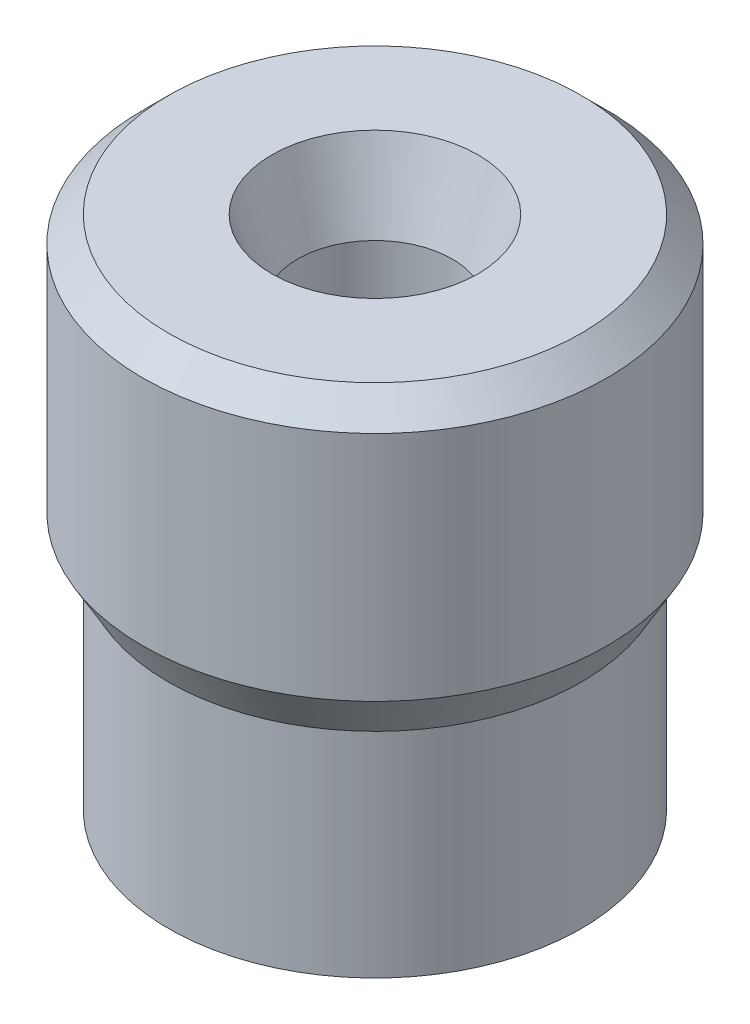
from build123d import *

# Parameters (mm, degrees)
SKICA1_R                 = 8
P_IDAT_VYSUNUT_M1_DEPTH  = 8.3
SKICA2_R                 = 9
P_IDAT_VYSUNUT_M2_DEPTH  = 11.7
ZKOSEN_1_SIZE            = 1.7
ZKOSEN_1_SIZE2           = 0.981495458
ZKOSEN_2_SIZE            = 1
SKICA3_R                 = 2
ODEBRAT_VYSUNUT_M1_DEPTH = 11
SKICA4_R                 = 3
ODEBRAT_VYSUNUT_M2_DEPTH = 9
ZKOSEN_3_SIZE            = 1
ZKOSEN_3_SIZE2           = 3


with BuildPart() as part:
    # Skica1 → P_idat vysunut_m1 (new body)
    with BuildSketch(Plane(origin=(0, 0, 0), x_dir=(1, 0, 0), z_dir=(0, 1, 0))):
        with Locations(Location((0, 0, 0), (0, 0, 90))):
            Circle(SKICA1_R)
    extrude(amount=P_IDAT_VYSUNUT_M1_DEPTH)

    # Skica2 → P_idat vysunut_m2 (add)
    with BuildSketch(Plane(origin=(0, 8.3, 0), x_dir=(-1, 0, 0), z_dir=(0, 1, 0))):
        with Locations(Location((0, 0, 0), (0, 0, 90))):
            Circle(SKICA2_R)
    extrude(amount=P_IDAT_VYSUNUT_M2_DEPTH)

    # Zkosen_1
    zkosen_1_edges = [part.edges().sort_by_distance(p)[0] for p in [
        (0, 8.3, -9),
    ]]
    zkosen_1_side = [part.faces().sort_by_distance(p)[0] for p in [
        (0, 14.15, -9),
    ]]
    chamfer(zkosen_1_edges, length=ZKOSEN_1_SIZE, length2=ZKOSEN_1_SIZE2, reference=zkosen_1_side[0])

    # Zkosen_2
    zkosen_2_edges = [part.edges().sort_by_distance(p)[0] for p in [
        (0, 20, -9),
    ]]
    chamfer(zkosen_2_edges, length=ZKOSEN_2_SIZE)

    # Skica3 → Odebrat vysunut_m1 (cut)
    with BuildSketch(Plane.XZ):
        with Locations(Location((0, 0, 0), (0, 0, 270))):
            Circle(SKICA3_R)
    extrude(amount=-ODEBRAT_VYSUNUT_M1_DEPTH, mode=Mode.SUBTRACT)

    # Skica4 → Odebrat vysunut_m2 (cut)
    with BuildSketch(Plane(origin=(0, 20, 0), x_dir=(1, 0, 0), z_dir=(0, 1, 0))):
        with Locations(Location((0, 0, 0), (0, 0, 270))):
            Circle(SKICA4_R)
    extrude(amount=-ODEBRAT_VYSUNUT_M2_DEPTH, mode=Mode.SUBTRACT)

    # Zkosen_3
    zkosen_3_edges = [part.edges().sort_by_distance(p)[0] for p in [
        (0, 20, -3),
    ]]
    zkosen_3_side = [part.faces().sort_by_distance(p)[0] for p in [
        (0, 20, -7.77372583),
    ]]
    chamfer(zkosen_3_edges, length=ZKOSEN_3_SIZE, length2=ZKOSEN_3_SIZE2, reference=zkosen_3_side[0])


solid = part.part
